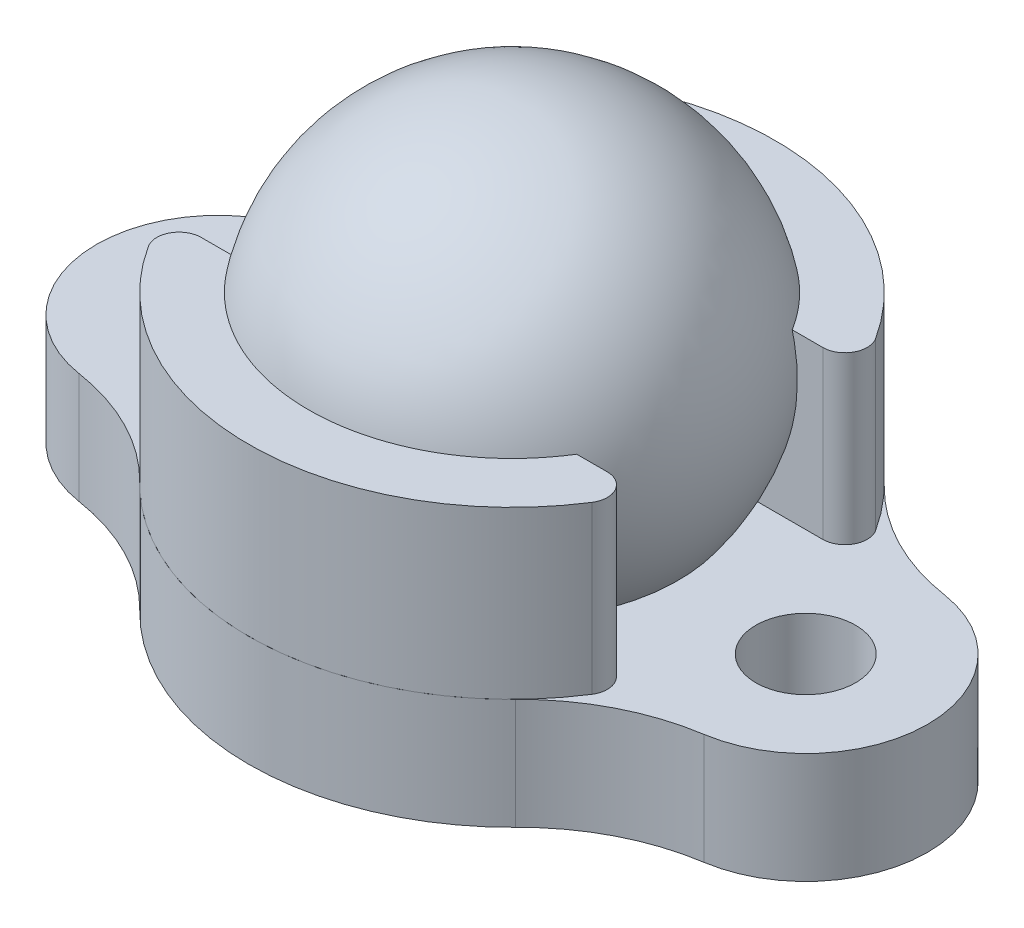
ISO-10303-21;
HEADER;
FILE_DESCRIPTION(('STEP AP214'),'2;1');
FILE_NAME('part.step','',(''),(''),'','','');
FILE_SCHEMA(('AUTOMOTIVE_DESIGN { 1 0 10303 214 1 1 1 1 }'));
ENDSEC;
DATA;
#1=APPLICATION_CONTEXT('core data for automotive mechanical design processes');
#2=APPLICATION_PROTOCOL_DEFINITION('international standard','automotive_design',2000,#1);
#3=PRODUCT_CONTEXT('',#1,'mechanical');
#4=PRODUCT('Part','Part','',(#3));
#5=PRODUCT_RELATED_PRODUCT_CATEGORY('part','',(#4));
#6=PRODUCT_DEFINITION_FORMATION('','',#4);
#7=PRODUCT_DEFINITION_CONTEXT('part definition',#1,'design');
#8=PRODUCT_DEFINITION('design','',#6,#7);
#9=PRODUCT_DEFINITION_SHAPE('','',#8);
#10=(LENGTH_UNIT() NAMED_UNIT(*) SI_UNIT(.MILLI.,.METRE.));
#11=(NAMED_UNIT(*) PLANE_ANGLE_UNIT() SI_UNIT($,.RADIAN.));
#12=(NAMED_UNIT(*) SI_UNIT($,.STERADIAN.) SOLID_ANGLE_UNIT());
#13=UNCERTAINTY_MEASURE_WITH_UNIT(LENGTH_MEASURE(1.E-05),#10,'distance_accuracy_value','');
#14=(GEOMETRIC_REPRESENTATION_CONTEXT(3) GLOBAL_UNCERTAINTY_ASSIGNED_CONTEXT((#13)) GLOBAL_UNIT_ASSIGNED_CONTEXT((#10,
#11,#12)) REPRESENTATION_CONTEXT('',''));
#15=CARTESIAN_POINT('',(0.,0.,0.));
#16=DIRECTION('',(0.,0.,1.));
#17=DIRECTION('',(1.,0.,0.));
#18=AXIS2_PLACEMENT_3D('',#15,#16,#17);
#19=CARTESIAN_POINT('',(0.,6.35,0.));
#20=DIRECTION('',(0.,-1.,0.));
#21=DIRECTION('',(0.,0.,-1.));
#22=AXIS2_PLACEMENT_3D('',#19,#20,#21);
#23=CYLINDRICAL_SURFACE('',#22,6.0325);
#24=CARTESIAN_POINT('',(0.,6.35,0.));
#25=DIRECTION('',(0.,1.,0.));
#26=DIRECTION('',(0.,0.,1.));
#27=AXIS2_PLACEMENT_3D('',#24,#25,#26);
#28=CIRCLE('',#27,6.0325);
#29=CARTESIAN_POINT('',(5.08156743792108,6.35,-3.25095810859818));
#30=VERTEX_POINT('',#29);
#31=CARTESIAN_POINT('',(-5.08156743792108,6.35,-3.25095810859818));
#32=VERTEX_POINT('',#31);
#33=EDGE_CURVE('E83',#30,#32,#28,.T.);
#34=ORIENTED_EDGE('',*,*,#33,.F.);
#35=DIRECTION('',(0.,-1.,0.));
#36=VECTOR('',#35,1.);
#37=CARTESIAN_POINT('',(5.08156743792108,6.35,-3.25095810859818));
#38=LINE('',#37,#36);
#39=CARTESIAN_POINT('',(5.08156743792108,2.54,-3.25095810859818));
#40=VERTEX_POINT('',#39);
#41=EDGE_CURVE('E91',#30,#40,#38,.T.);
#42=ORIENTED_EDGE('',*,*,#41,.T.);
#43=CARTESIAN_POINT('',(0.,2.54,0.));
#44=DIRECTION('',(0.,1.,0.));
#45=DIRECTION('',(0.,0.,1.));
#46=AXIS2_PLACEMENT_3D('',#43,#44,#45);
#47=CIRCLE('',#46,6.0325);
#48=CARTESIAN_POINT('',(-5.08156743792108,2.54,-3.25095810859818));
#49=VERTEX_POINT('',#48);
#50=EDGE_CURVE('E96',#40,#49,#47,.T.);
#51=ORIENTED_EDGE('',*,*,#50,.T.);
#52=DIRECTION('',(0.,-1.,0.));
#53=VECTOR('',#52,1.);
#54=CARTESIAN_POINT('',(-5.08156743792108,6.35,-3.25095810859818));
#55=LINE('',#54,#53);
#56=EDGE_CURVE('E94',#49,#32,#55,.F.);
#57=ORIENTED_EDGE('',*,*,#56,.T.);
#58=EDGE_LOOP('',(#34,#42,#51,#57));
#59=FACE_BOUND('',#58,.T.);
#60=ADVANCED_FACE('F43',(#59),#23,.T.);
#61=CARTESIAN_POINT('',(0.,6.35,0.));
#62=DIRECTION('',(0.,1.,0.));
#63=DIRECTION('',(0.,0.,1.));
#64=AXIS2_PLACEMENT_3D('',#61,#62,#63);
#65=PLANE('',#64);
#66=DIRECTION('',(-1.,0.,0.));
#67=VECTOR('',#66,1.);
#68=CARTESIAN_POINT('',(6.0325,6.35,-2.46919321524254));
#69=LINE('',#68,#67);
#70=CARTESIAN_POINT('',(4.65364596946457,6.35,-2.46919321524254));
#71=VERTEX_POINT('',#70);
#72=CARTESIAN_POINT('',(-4.65364596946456,6.35,-2.46919321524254));
#73=VERTEX_POINT('',#72);
#74=EDGE_CURVE('E84',#71,#73,#69,.T.);
#75=ORIENTED_EDGE('',*,*,#74,.F.);
#76=CARTESIAN_POINT('',(4.65364596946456,6.35,-2.97719321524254));
#77=DIRECTION('',(0.,1.,0.));
#78=DIRECTION('',(0.,0.,1.));
#79=AXIS2_PLACEMENT_3D('',#76,#77,#78);
#80=CIRCLE('',#79,0.508);
#81=EDGE_CURVE('E12',#71,#30,#80,.T.);
#82=ORIENTED_EDGE('',*,*,#81,.T.);
#83=ORIENTED_EDGE('',*,*,#33,.T.);
#84=CARTESIAN_POINT('',(-4.65364596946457,6.35,-2.97719321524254));
#85=DIRECTION('',(0.,1.,0.));
#86=DIRECTION('',(0.,0.,1.));
#87=AXIS2_PLACEMENT_3D('',#84,#85,#86);
#88=CIRCLE('',#87,0.508);
#89=EDGE_CURVE('E51',#32,#73,#88,.T.);
#90=ORIENTED_EDGE('',*,*,#89,.T.);
#91=EDGE_LOOP('',(#75,#82,#83,#90));
#92=FACE_BOUND('',#91,.T.);
#93=ADVANCED_FACE('F82',(#92),#65,.T.);
#94=CARTESIAN_POINT('',(0.,2.54,0.));
#95=DIRECTION('',(0.,1.,0.));
#96=DIRECTION('',(0.,0.,1.));
#97=AXIS2_PLACEMENT_3D('',#94,#95,#96);
#98=PLANE('',#97);
#99=ORIENTED_EDGE('',*,*,#50,.F.);
#100=CARTESIAN_POINT('',(4.65364596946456,2.54,-2.97719321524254));
#101=DIRECTION('',(0.,1.,0.));
#102=DIRECTION('',(0.,0.,1.));
#103=AXIS2_PLACEMENT_3D('',#100,#101,#102);
#104=CIRCLE('',#103,0.508);
#105=CARTESIAN_POINT('',(4.65364596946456,2.54,-2.46919321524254));
#106=VERTEX_POINT('',#105);
#107=EDGE_CURVE('E99',#40,#106,#104,.F.);
#108=ORIENTED_EDGE('',*,*,#107,.T.);
#109=DIRECTION('',(-1.,0.,0.));
#110=VECTOR('',#109,1.);
#111=CARTESIAN_POINT('',(0.,2.54,-2.46919321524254));
#112=LINE('',#111,#110);
#113=CARTESIAN_POINT('',(-4.65364596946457,2.54,-2.46919321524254));
#114=VERTEX_POINT('',#113);
#115=EDGE_CURVE('E95',#106,#114,#112,.T.);
#116=ORIENTED_EDGE('',*,*,#115,.T.);
#117=CARTESIAN_POINT('',(-4.65364596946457,2.54,-2.97719321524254));
#118=DIRECTION('',(0.,1.,0.));
#119=DIRECTION('',(0.,0.,1.));
#120=AXIS2_PLACEMENT_3D('',#117,#118,#119);
#121=CIRCLE('',#120,0.508);
#122=EDGE_CURVE('E100',#114,#49,#121,.F.);
#123=ORIENTED_EDGE('',*,*,#122,.T.);
#124=EDGE_LOOP('',(#99,#108,#116,#123));
#125=FACE_BOUND('',#124,.T.);
#126=ADVANCED_FACE('F115',(#125),#98,.F.);
#127=CARTESIAN_POINT('',(6.0325,-10.4965595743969,-2.46919321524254));
#128=DIRECTION('',(0.,0.,-1.));
#129=DIRECTION('',(-1.,0.,0.));
#130=AXIS2_PLACEMENT_3D('',#127,#128,#129);
#131=PLANE('',#130);
#132=ORIENTED_EDGE('',*,*,#115,.F.);
#133=DIRECTION('',(0.,-1.,0.));
#134=VECTOR('',#133,1.);
#135=CARTESIAN_POINT('',(4.65364596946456,-10.4965595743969,-2.46919321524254));
#136=LINE('',#135,#134);
#137=EDGE_CURVE('E64',#106,#71,#136,.F.);
#138=ORIENTED_EDGE('',*,*,#137,.T.);
#139=ORIENTED_EDGE('',*,*,#74,.T.);
#140=DIRECTION('',(0.,-1.,0.));
#141=VECTOR('',#140,1.);
#142=CARTESIAN_POINT('',(-4.65364596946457,-10.4965595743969,-2.46919321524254));
#143=LINE('',#142,#141);
#144=EDGE_CURVE('E107',#73,#114,#143,.T.);
#145=ORIENTED_EDGE('',*,*,#144,.T.);
#146=EDGE_LOOP('',(#132,#138,#139,#145));
#147=FACE_BOUND('',#146,.T.);
#148=ADVANCED_FACE('F111',(#147),#131,.F.);
#149=CARTESIAN_POINT('',(4.65364596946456,6.35,-2.97719321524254));
#150=DIRECTION('',(0.,-1.,0.));
#151=DIRECTION('',(0.,0.,-1.));
#152=AXIS2_PLACEMENT_3D('',#149,#150,#151);
#153=CYLINDRICAL_SURFACE('',#152,0.508);
#154=ORIENTED_EDGE('',*,*,#81,.F.);
#155=ORIENTED_EDGE('',*,*,#137,.F.);
#156=ORIENTED_EDGE('',*,*,#107,.F.);
#157=ORIENTED_EDGE('',*,*,#41,.F.);
#158=EDGE_LOOP('',(#154,#155,#156,#157));
#159=FACE_BOUND('',#158,.T.);
#160=ADVANCED_FACE('F98',(#159),#153,.T.);
#161=CARTESIAN_POINT('',(-4.65364596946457,6.35,-2.97719321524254));
#162=DIRECTION('',(0.,-1.,0.));
#163=DIRECTION('',(0.,0.,-1.));
#164=AXIS2_PLACEMENT_3D('',#161,#162,#163);
#165=CYLINDRICAL_SURFACE('',#164,0.508);
#166=ORIENTED_EDGE('',*,*,#122,.F.);
#167=ORIENTED_EDGE('',*,*,#144,.F.);
#168=ORIENTED_EDGE('',*,*,#89,.F.);
#169=ORIENTED_EDGE('',*,*,#56,.F.);
#170=EDGE_LOOP('',(#166,#167,#168,#169));
#171=FACE_BOUND('',#170,.T.);
#172=ADVANCED_FACE('F45',(#171),#165,.T.);
#173=CLOSED_SHELL('',(#60,#93,#126,#148,#160,#172));
#174=MANIFOLD_SOLID_BREP('B2',#173);
#175=CARTESIAN_POINT('',(0.,2.54,0.));
#176=DIRECTION('',(0.,1.,0.));
#177=DIRECTION('',(0.,0.,1.));
#178=AXIS2_PLACEMENT_3D('',#175,#176,#177);
#179=PLANE('',#178);
#180=CARTESIAN_POINT('',(0.,2.54,0.));
#181=DIRECTION('',(0.,1.,0.));
#182=DIRECTION('',(0.,0.,1.));
#183=AXIS2_PLACEMENT_3D('',#180,#181,#182);
#184=CIRCLE('',#183,6.0325);
#185=CARTESIAN_POINT('',(-5.08156743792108,2.54,3.25095810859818));
#186=VERTEX_POINT('',#185);
#187=CARTESIAN_POINT('',(5.08156743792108,2.54,3.25095810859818));
#188=VERTEX_POINT('',#187);
#189=EDGE_CURVE('E230',#186,#188,#184,.T.);
#190=ORIENTED_EDGE('',*,*,#189,.F.);
#191=CARTESIAN_POINT('',(-4.65364596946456,2.54,2.97719321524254));
#192=DIRECTION('',(0.,1.,0.));
#193=DIRECTION('',(0.,0.,1.));
#194=AXIS2_PLACEMENT_3D('',#191,#192,#193);
#195=CIRCLE('',#194,0.508);
#196=CARTESIAN_POINT('',(-4.65364596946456,2.54,2.46919321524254));
#197=VERTEX_POINT('',#196);
#198=EDGE_CURVE('E233',#186,#197,#195,.F.);
#199=ORIENTED_EDGE('',*,*,#198,.T.);
#200=DIRECTION('',(1.,0.,0.));
#201=VECTOR('',#200,1.);
#202=CARTESIAN_POINT('',(0.,2.54,2.46919321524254));
#203=LINE('',#202,#201);
#204=CARTESIAN_POINT('',(4.65364596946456,2.54,2.46919321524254));
#205=VERTEX_POINT('',#204);
#206=EDGE_CURVE('E229',#197,#205,#203,.T.);
#207=ORIENTED_EDGE('',*,*,#206,.T.);
#208=CARTESIAN_POINT('',(4.65364596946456,2.54,2.97719321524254));
#209=DIRECTION('',(0.,1.,0.));
#210=DIRECTION('',(0.,0.,1.));
#211=AXIS2_PLACEMENT_3D('',#208,#209,#210);
#212=CIRCLE('',#211,0.508);
#213=EDGE_CURVE('E234',#205,#188,#212,.F.);
#214=ORIENTED_EDGE('',*,*,#213,.T.);
#215=EDGE_LOOP('',(#190,#199,#207,#214));
#216=FACE_BOUND('',#215,.T.);
#217=ADVANCED_FACE('F176',(#216),#179,.F.);
#218=CARTESIAN_POINT('',(0.,6.35,0.));
#219=DIRECTION('',(0.,1.,0.));
#220=DIRECTION('',(0.,0.,1.));
#221=AXIS2_PLACEMENT_3D('',#218,#219,#220);
#222=PLANE('',#221);
#223=DIRECTION('',(1.,0.,0.));
#224=VECTOR('',#223,1.);
#225=CARTESIAN_POINT('',(6.0325,6.35,2.46919321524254));
#226=LINE('',#225,#224);
#227=CARTESIAN_POINT('',(-4.65364596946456,6.35,2.46919321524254));
#228=VERTEX_POINT('',#227);
#229=CARTESIAN_POINT('',(4.65364596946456,6.35,2.46919321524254));
#230=VERTEX_POINT('',#229);
#231=EDGE_CURVE('E217',#228,#230,#226,.T.);
#232=ORIENTED_EDGE('',*,*,#231,.F.);
#233=CARTESIAN_POINT('',(-4.65364596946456,6.35,2.97719321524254));
#234=DIRECTION('',(0.,1.,0.));
#235=DIRECTION('',(0.,0.,1.));
#236=AXIS2_PLACEMENT_3D('',#233,#234,#235);
#237=CIRCLE('',#236,0.508);
#238=CARTESIAN_POINT('',(-5.08156743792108,6.35,3.25095810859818));
#239=VERTEX_POINT('',#238);
#240=EDGE_CURVE('E41',#228,#239,#237,.T.);
#241=ORIENTED_EDGE('',*,*,#240,.T.);
#242=CARTESIAN_POINT('',(0.,6.35,0.));
#243=DIRECTION('',(0.,1.,0.));
#244=DIRECTION('',(0.,0.,1.));
#245=AXIS2_PLACEMENT_3D('',#242,#243,#244);
#246=CIRCLE('',#245,6.0325);
#247=CARTESIAN_POINT('',(5.08156743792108,6.35,3.25095810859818));
#248=VERTEX_POINT('',#247);
#249=EDGE_CURVE('E216',#239,#248,#246,.T.);
#250=ORIENTED_EDGE('',*,*,#249,.T.);
#251=CARTESIAN_POINT('',(4.65364596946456,6.35,2.97719321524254));
#252=DIRECTION('',(0.,1.,0.));
#253=DIRECTION('',(0.,0.,1.));
#254=AXIS2_PLACEMENT_3D('',#251,#252,#253);
#255=CIRCLE('',#254,0.508);
#256=EDGE_CURVE('E184',#248,#230,#255,.T.);
#257=ORIENTED_EDGE('',*,*,#256,.T.);
#258=EDGE_LOOP('',(#232,#241,#250,#257));
#259=FACE_BOUND('',#258,.T.);
#260=ADVANCED_FACE('F215',(#259),#222,.T.);
#261=CARTESIAN_POINT('',(0.,6.35,0.));
#262=DIRECTION('',(0.,-1.,0.));
#263=DIRECTION('',(0.,0.,-1.));
#264=AXIS2_PLACEMENT_3D('',#261,#262,#263);
#265=CYLINDRICAL_SURFACE('',#264,6.0325);
#266=ORIENTED_EDGE('',*,*,#249,.F.);
#267=DIRECTION('',(0.,-1.,0.));
#268=VECTOR('',#267,1.);
#269=CARTESIAN_POINT('',(-5.08156743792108,6.35,3.25095810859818));
#270=LINE('',#269,#268);
#271=EDGE_CURVE('E225',#239,#186,#270,.T.);
#272=ORIENTED_EDGE('',*,*,#271,.T.);
#273=ORIENTED_EDGE('',*,*,#189,.T.);
#274=DIRECTION('',(0.,-1.,0.));
#275=VECTOR('',#274,1.);
#276=CARTESIAN_POINT('',(5.08156743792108,6.35,3.25095810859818));
#277=LINE('',#276,#275);
#278=EDGE_CURVE('E228',#188,#248,#277,.F.);
#279=ORIENTED_EDGE('',*,*,#278,.T.);
#280=EDGE_LOOP('',(#266,#272,#273,#279));
#281=FACE_BOUND('',#280,.T.);
#282=ADVANCED_FACE('F223',(#281),#265,.T.);
#283=CARTESIAN_POINT('',(6.0325,-10.4965595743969,2.46919321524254));
#284=DIRECTION('',(0.,0.,1.));
#285=DIRECTION('',(1.,0.,0.));
#286=AXIS2_PLACEMENT_3D('',#283,#284,#285);
#287=PLANE('',#286);
#288=ORIENTED_EDGE('',*,*,#206,.F.);
#289=DIRECTION('',(0.,-1.,0.));
#290=VECTOR('',#289,1.);
#291=CARTESIAN_POINT('',(-4.65364596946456,-10.4965595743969,2.46919321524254));
#292=LINE('',#291,#290);
#293=EDGE_CURVE('E197',#197,#228,#292,.F.);
#294=ORIENTED_EDGE('',*,*,#293,.T.);
#295=ORIENTED_EDGE('',*,*,#231,.T.);
#296=DIRECTION('',(0.,-1.,0.));
#297=VECTOR('',#296,1.);
#298=CARTESIAN_POINT('',(4.65364596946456,-10.4965595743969,2.46919321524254));
#299=LINE('',#298,#297);
#300=EDGE_CURVE('E241',#230,#205,#299,.T.);
#301=ORIENTED_EDGE('',*,*,#300,.T.);
#302=EDGE_LOOP('',(#288,#294,#295,#301));
#303=FACE_BOUND('',#302,.T.);
#304=ADVANCED_FACE('F245',(#303),#287,.F.);
#305=CARTESIAN_POINT('',(-4.65364596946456,6.35,2.97719321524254));
#306=DIRECTION('',(0.,-1.,0.));
#307=DIRECTION('',(0.,0.,-1.));
#308=AXIS2_PLACEMENT_3D('',#305,#306,#307);
#309=CYLINDRICAL_SURFACE('',#308,0.508);
#310=ORIENTED_EDGE('',*,*,#240,.F.);
#311=ORIENTED_EDGE('',*,*,#293,.F.);
#312=ORIENTED_EDGE('',*,*,#198,.F.);
#313=ORIENTED_EDGE('',*,*,#271,.F.);
#314=EDGE_LOOP('',(#310,#311,#312,#313));
#315=FACE_BOUND('',#314,.T.);
#316=ADVANCED_FACE('F232',(#315),#309,.T.);
#317=CARTESIAN_POINT('',(4.65364596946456,6.35,2.97719321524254));
#318=DIRECTION('',(0.,-1.,0.));
#319=DIRECTION('',(0.,0.,-1.));
#320=AXIS2_PLACEMENT_3D('',#317,#318,#319);
#321=CYLINDRICAL_SURFACE('',#320,0.508);
#322=ORIENTED_EDGE('',*,*,#213,.F.);
#323=ORIENTED_EDGE('',*,*,#300,.F.);
#324=ORIENTED_EDGE('',*,*,#256,.F.);
#325=ORIENTED_EDGE('',*,*,#278,.F.);
#326=EDGE_LOOP('',(#322,#323,#324,#325));
#327=FACE_BOUND('',#326,.T.);
#328=ADVANCED_FACE('F178',(#327),#321,.T.);
#329=CLOSED_SHELL('',(#217,#260,#282,#304,#316,#328));
#330=MANIFOLD_SOLID_BREP('B6',#329);
#331=CARTESIAN_POINT('',(-3.96650353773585,2.54,3.89085642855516));
#332=DIRECTION('',(0.,-1.,0.));
#333=DIRECTION('',(0.,0.,-1.));
#334=AXIS2_PLACEMENT_3D('',#331,#332,#333);
#335=PLANE('',#334);
#336=CARTESIAN_POINT('',(6.731,2.54,0.));
#337=DIRECTION('',(0.,1.,0.));
#338=DIRECTION('',(0.,0.,1.));
#339=AXIS2_PLACEMENT_3D('',#336,#337,#338);
#340=CIRCLE('',#339,1.143);
#341=CARTESIAN_POINT('',(6.731,2.54,1.143));
#342=VERTEX_POINT('',#341);
#343=EDGE_CURVE('E453',#342,#342,#340,.T.);
#344=ORIENTED_EDGE('',*,*,#343,.F.);
#345=EDGE_LOOP('',(#344));
#346=FACE_BOUND('',#345,.T.);
#347=CARTESIAN_POINT('',(-7.9330070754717,2.54,7.78171285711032));
#348=DIRECTION('',(0.,-1.,0.));
#349=DIRECTION('',(0.,0.,-1.));
#350=AXIS2_PLACEMENT_3D('',#347,#348,#349);
#351=CIRCLE('',#350,5.08);
#352=CARTESIAN_POINT('',(-7.15751863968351,2.54,2.76125294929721));
#353=VERTEX_POINT('',#352);
#354=CARTESIAN_POINT('',(-4.30648955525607,2.54,4.2243584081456));
#355=VERTEX_POINT('',#354);
#356=EDGE_CURVE('E412',#353,#355,#351,.T.);
#357=ORIENTED_EDGE('',*,*,#356,.T.);
#358=CARTESIAN_POINT('',(0.,2.54,0.));
#359=DIRECTION('',(0.,1.,0.));
#360=DIRECTION('',(0.,0.,1.));
#361=AXIS2_PLACEMENT_3D('',#358,#359,#360);
#362=CIRCLE('',#361,6.0325);
#363=CARTESIAN_POINT('',(4.30648955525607,2.54,4.2243584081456));
#364=VERTEX_POINT('',#363);
#365=EDGE_CURVE('E360',#355,#364,#362,.T.);
#366=ORIENTED_EDGE('',*,*,#365,.T.);
#367=CARTESIAN_POINT('',(7.9330070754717,2.54,7.78171285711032));
#368=DIRECTION('',(0.,-1.,0.));
#369=DIRECTION('',(0.,0.,-1.));
#370=AXIS2_PLACEMENT_3D('',#367,#368,#369);
#371=CIRCLE('',#370,5.08);
#372=CARTESIAN_POINT('',(7.15751863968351,2.54,2.76125294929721));
#373=VERTEX_POINT('',#372);
#374=EDGE_CURVE('E444',#364,#373,#371,.T.);
#375=ORIENTED_EDGE('',*,*,#374,.T.);
#376=CARTESIAN_POINT('',(6.731,2.54,0.));
#377=DIRECTION('',(0.,1.,0.));
#378=DIRECTION('',(0.,0.,1.));
#379=AXIS2_PLACEMENT_3D('',#376,#377,#378);
#380=CIRCLE('',#379,2.794);
#381=CARTESIAN_POINT('',(7.15751863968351,2.54,-2.76125294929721));
#382=VERTEX_POINT('',#381);
#383=EDGE_CURVE('E443',#373,#382,#380,.T.);
#384=ORIENTED_EDGE('',*,*,#383,.T.);
#385=CARTESIAN_POINT('',(7.9330070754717,2.54,-7.78171285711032));
#386=DIRECTION('',(0.,-1.,0.));
#387=DIRECTION('',(0.,0.,-1.));
#388=AXIS2_PLACEMENT_3D('',#385,#386,#387);
#389=CIRCLE('',#388,5.08);
#390=CARTESIAN_POINT('',(4.30648955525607,2.54,-4.2243584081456));
#391=VERTEX_POINT('',#390);
#392=EDGE_CURVE('E379',#382,#391,#389,.T.);
#393=ORIENTED_EDGE('',*,*,#392,.T.);
#394=CARTESIAN_POINT('',(0.,2.54,0.));
#395=DIRECTION('',(0.,1.,0.));
#396=DIRECTION('',(0.,0.,1.));
#397=AXIS2_PLACEMENT_3D('',#394,#395,#396);
#398=CIRCLE('',#397,6.0325);
#399=CARTESIAN_POINT('',(-4.30648955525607,2.54,-4.2243584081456));
#400=VERTEX_POINT('',#399);
#401=EDGE_CURVE('E373',#391,#400,#398,.T.);
#402=ORIENTED_EDGE('',*,*,#401,.T.);
#403=CARTESIAN_POINT('',(-7.9330070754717,2.54,-7.78171285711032));
#404=DIRECTION('',(0.,-1.,0.));
#405=DIRECTION('',(0.,0.,1.));
#406=AXIS2_PLACEMENT_3D('',#403,#404,#405);
#407=CIRCLE('',#406,5.08);
#408=CARTESIAN_POINT('',(-7.1575186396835,2.54,-2.76125294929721));
#409=VERTEX_POINT('',#408);
#410=EDGE_CURVE('E377',#400,#409,#407,.T.);
#411=ORIENTED_EDGE('',*,*,#410,.T.);
#412=CARTESIAN_POINT('',(-6.731,2.54,0.));
#413=DIRECTION('',(0.,1.,0.));
#414=DIRECTION('',(0.,0.,1.));
#415=AXIS2_PLACEMENT_3D('',#412,#413,#414);
#416=CIRCLE('',#415,2.794);
#417=EDGE_CURVE('E316',#409,#353,#416,.T.);
#418=ORIENTED_EDGE('',*,*,#417,.T.);
#419=EDGE_LOOP('',(#357,#366,#375,#384,#393,#402,#411,#418));
#420=FACE_BOUND('',#419,.T.);
#421=CARTESIAN_POINT('',(-6.731,2.54,0.));
#422=DIRECTION('',(0.,1.,0.));
#423=DIRECTION('',(0.,0.,1.));
#424=AXIS2_PLACEMENT_3D('',#421,#422,#423);
#425=CIRCLE('',#424,1.143);
#426=CARTESIAN_POINT('',(-6.731,2.54,1.143));
#427=VERTEX_POINT('',#426);
#428=EDGE_CURVE('E401',#427,#427,#425,.T.);
#429=ORIENTED_EDGE('',*,*,#428,.F.);
#430=EDGE_LOOP('',(#429));
#431=FACE_BOUND('',#430,.T.);
#432=CARTESIAN_POINT('',(0.,2.54,0.));
#433=DIRECTION('',(0.,-1.,0.));
#434=DIRECTION('',(0.,0.,-1.));
#435=AXIS2_PLACEMENT_3D('',#432,#433,#434);
#436=CIRCLE('',#435,3.81);
#437=CARTESIAN_POINT('',(0.,2.54,-3.81));
#438=VERTEX_POINT('',#437);
#439=EDGE_CURVE('E174',#438,#438,#436,.F.);
#440=ORIENTED_EDGE('',*,*,#439,.F.);
#441=EDGE_LOOP('',(#440));
#442=FACE_BOUND('',#441,.T.);
#443=ADVANCED_FACE('F299',(#346,#420,#431,#442),#335,.F.);
#444=CARTESIAN_POINT('',(-3.96650353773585,0.,3.89085642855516));
#445=DIRECTION('',(0.,-1.,0.));
#446=DIRECTION('',(0.,0.,-1.));
#447=AXIS2_PLACEMENT_3D('',#444,#445,#446);
#448=PLANE('',#447);
#449=CARTESIAN_POINT('',(-6.731,0.,0.));
#450=DIRECTION('',(0.,1.,0.));
#451=DIRECTION('',(0.,0.,1.));
#452=AXIS2_PLACEMENT_3D('',#449,#450,#451);
#453=CIRCLE('',#452,1.143);
#454=CARTESIAN_POINT('',(-6.731,0.,1.143));
#455=VERTEX_POINT('',#454);
#456=EDGE_CURVE('E450',#455,#455,#453,.T.);
#457=ORIENTED_EDGE('',*,*,#456,.T.);
#458=EDGE_LOOP('',(#457));
#459=FACE_BOUND('',#458,.T.);
#460=CARTESIAN_POINT('',(-7.9330070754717,0.,7.78171285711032));
#461=DIRECTION('',(0.,-1.,0.));
#462=DIRECTION('',(0.,0.,-1.));
#463=AXIS2_PLACEMENT_3D('',#460,#461,#462);
#464=CIRCLE('',#463,5.08);
#465=CARTESIAN_POINT('',(-7.15751863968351,0.,2.76125294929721));
#466=VERTEX_POINT('',#465);
#467=CARTESIAN_POINT('',(-4.30648955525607,0.,4.2243584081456));
#468=VERTEX_POINT('',#467);
#469=EDGE_CURVE('E397',#466,#468,#464,.T.);
#470=ORIENTED_EDGE('',*,*,#469,.F.);
#471=CARTESIAN_POINT('',(-6.731,0.,0.));
#472=DIRECTION('',(0.,1.,0.));
#473=DIRECTION('',(0.,0.,1.));
#474=AXIS2_PLACEMENT_3D('',#471,#472,#473);
#475=CIRCLE('',#474,2.794);
#476=CARTESIAN_POINT('',(-7.1575186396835,0.,-2.76125294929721));
#477=VERTEX_POINT('',#476);
#478=EDGE_CURVE('E351',#477,#466,#475,.T.);
#479=ORIENTED_EDGE('',*,*,#478,.F.);
#480=CARTESIAN_POINT('',(-7.9330070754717,0.,-7.78171285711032));
#481=DIRECTION('',(0.,-1.,0.));
#482=DIRECTION('',(0.,0.,1.));
#483=AXIS2_PLACEMENT_3D('',#480,#481,#482);
#484=CIRCLE('',#483,5.08);
#485=CARTESIAN_POINT('',(-4.30648955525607,0.,-4.2243584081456));
#486=VERTEX_POINT('',#485);
#487=EDGE_CURVE('E345',#486,#477,#484,.T.);
#488=ORIENTED_EDGE('',*,*,#487,.F.);
#489=CARTESIAN_POINT('',(0.,0.,0.));
#490=DIRECTION('',(0.,1.,0.));
#491=DIRECTION('',(0.,0.,1.));
#492=AXIS2_PLACEMENT_3D('',#489,#490,#491);
#493=CIRCLE('',#492,6.0325);
#494=CARTESIAN_POINT('',(4.30648955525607,0.,-4.2243584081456));
#495=VERTEX_POINT('',#494);
#496=EDGE_CURVE('E387',#495,#486,#493,.T.);
#497=ORIENTED_EDGE('',*,*,#496,.F.);
#498=CARTESIAN_POINT('',(7.9330070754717,0.,-7.78171285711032));
#499=DIRECTION('',(0.,-1.,0.));
#500=DIRECTION('',(0.,0.,-1.));
#501=AXIS2_PLACEMENT_3D('',#498,#499,#500);
#502=CIRCLE('',#501,5.08);
#503=CARTESIAN_POINT('',(7.15751863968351,0.,-2.76125294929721));
#504=VERTEX_POINT('',#503);
#505=EDGE_CURVE('E407',#504,#495,#502,.T.);
#506=ORIENTED_EDGE('',*,*,#505,.F.);
#507=CARTESIAN_POINT('',(6.731,0.,0.));
#508=DIRECTION('',(0.,1.,0.));
#509=DIRECTION('',(0.,0.,1.));
#510=AXIS2_PLACEMENT_3D('',#507,#508,#509);
#511=CIRCLE('',#510,2.794);
#512=CARTESIAN_POINT('',(7.15751863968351,0.,2.76125294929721));
#513=VERTEX_POINT('',#512);
#514=EDGE_CURVE('E405',#513,#504,#511,.T.);
#515=ORIENTED_EDGE('',*,*,#514,.F.);
#516=CARTESIAN_POINT('',(7.9330070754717,0.,7.78171285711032));
#517=DIRECTION('',(0.,-1.,0.));
#518=DIRECTION('',(0.,0.,-1.));
#519=AXIS2_PLACEMENT_3D('',#516,#517,#518);
#520=CIRCLE('',#519,5.08);
#521=CARTESIAN_POINT('',(4.30648955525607,0.,4.2243584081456));
#522=VERTEX_POINT('',#521);
#523=EDGE_CURVE('E403',#522,#513,#520,.T.);
#524=ORIENTED_EDGE('',*,*,#523,.F.);
#525=CARTESIAN_POINT('',(0.,0.,0.));
#526=DIRECTION('',(0.,1.,0.));
#527=DIRECTION('',(0.,0.,1.));
#528=AXIS2_PLACEMENT_3D('',#525,#526,#527);
#529=CIRCLE('',#528,6.0325);
#530=EDGE_CURVE('E400',#468,#522,#529,.T.);
#531=ORIENTED_EDGE('',*,*,#530,.F.);
#532=EDGE_LOOP('',(#470,#479,#488,#497,#506,#515,#524,#531));
#533=FACE_BOUND('',#532,.T.);
#534=CARTESIAN_POINT('',(6.731,0.,0.));
#535=DIRECTION('',(0.,1.,0.));
#536=DIRECTION('',(0.,0.,1.));
#537=AXIS2_PLACEMENT_3D('',#534,#535,#536);
#538=CIRCLE('',#537,1.143);
#539=CARTESIAN_POINT('',(6.731,0.,1.143));
#540=VERTEX_POINT('',#539);
#541=EDGE_CURVE('E456',#540,#540,#538,.T.);
#542=ORIENTED_EDGE('',*,*,#541,.T.);
#543=EDGE_LOOP('',(#542));
#544=FACE_BOUND('',#543,.T.);
#545=ADVANCED_FACE('F430',(#459,#533,#544),#448,.T.);
#546=CARTESIAN_POINT('',(-7.9330070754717,2.54,7.78171285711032));
#547=DIRECTION('',(0.,-1.,0.));
#548=DIRECTION('',(0.,0.,-1.));
#549=AXIS2_PLACEMENT_3D('',#546,#547,#548);
#550=CYLINDRICAL_SURFACE('',#549,5.08);
#551=ORIENTED_EDGE('',*,*,#469,.T.);
#552=DIRECTION('',(0.,-1.,0.));
#553=VECTOR('',#552,1.);
#554=CARTESIAN_POINT('',(-4.30648955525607,2.54,4.2243584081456));
#555=LINE('',#554,#553);
#556=EDGE_CURVE('E308',#355,#468,#555,.T.);
#557=ORIENTED_EDGE('',*,*,#556,.F.);
#558=ORIENTED_EDGE('',*,*,#356,.F.);
#559=DIRECTION('',(0.,-1.,0.));
#560=VECTOR('',#559,1.);
#561=CARTESIAN_POINT('',(-7.15751863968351,2.54,2.76125294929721));
#562=LINE('',#561,#560);
#563=EDGE_CURVE('E393',#353,#466,#562,.T.);
#564=ORIENTED_EDGE('',*,*,#563,.T.);
#565=EDGE_LOOP('',(#551,#557,#558,#564));
#566=FACE_BOUND('',#565,.T.);
#567=ADVANCED_FACE('F301',(#566),#550,.F.);
#568=CARTESIAN_POINT('',(0.,2.54,0.));
#569=DIRECTION('',(0.,-1.,0.));
#570=DIRECTION('',(0.,0.,-1.));
#571=AXIS2_PLACEMENT_3D('',#568,#569,#570);
#572=CYLINDRICAL_SURFACE('',#571,6.0325);
#573=ORIENTED_EDGE('',*,*,#530,.T.);
#574=DIRECTION('',(0.,-1.,0.));
#575=VECTOR('',#574,1.);
#576=CARTESIAN_POINT('',(4.30648955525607,2.54,4.2243584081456));
#577=LINE('',#576,#575);
#578=EDGE_CURVE('E422',#364,#522,#577,.T.);
#579=ORIENTED_EDGE('',*,*,#578,.F.);
#580=ORIENTED_EDGE('',*,*,#365,.F.);
#581=ORIENTED_EDGE('',*,*,#556,.T.);
#582=EDGE_LOOP('',(#573,#579,#580,#581));
#583=FACE_BOUND('',#582,.T.);
#584=ADVANCED_FACE('F425',(#583),#572,.T.);
#585=CARTESIAN_POINT('',(7.9330070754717,2.54,7.78171285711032));
#586=DIRECTION('',(0.,-1.,0.));
#587=DIRECTION('',(0.,0.,-1.));
#588=AXIS2_PLACEMENT_3D('',#585,#586,#587);
#589=CYLINDRICAL_SURFACE('',#588,5.08);
#590=ORIENTED_EDGE('',*,*,#523,.T.);
#591=DIRECTION('',(0.,-1.,0.));
#592=VECTOR('',#591,1.);
#593=CARTESIAN_POINT('',(7.15751863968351,2.54,2.76125294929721));
#594=LINE('',#593,#592);
#595=EDGE_CURVE('E419',#373,#513,#594,.T.);
#596=ORIENTED_EDGE('',*,*,#595,.F.);
#597=ORIENTED_EDGE('',*,*,#374,.F.);
#598=ORIENTED_EDGE('',*,*,#578,.T.);
#599=EDGE_LOOP('',(#590,#596,#597,#598));
#600=FACE_BOUND('',#599,.T.);
#601=ADVANCED_FACE('F437',(#600),#589,.F.);
#602=CARTESIAN_POINT('',(6.731,2.54,0.));
#603=DIRECTION('',(0.,-1.,0.));
#604=DIRECTION('',(0.,0.,-1.));
#605=AXIS2_PLACEMENT_3D('',#602,#603,#604);
#606=CYLINDRICAL_SURFACE('',#605,2.794);
#607=ORIENTED_EDGE('',*,*,#514,.T.);
#608=DIRECTION('',(0.,-1.,0.));
#609=VECTOR('',#608,1.);
#610=CARTESIAN_POINT('',(7.15751863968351,2.54,-2.76125294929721));
#611=LINE('',#610,#609);
#612=EDGE_CURVE('E416',#382,#504,#611,.T.);
#613=ORIENTED_EDGE('',*,*,#612,.F.);
#614=ORIENTED_EDGE('',*,*,#383,.F.);
#615=ORIENTED_EDGE('',*,*,#595,.T.);
#616=EDGE_LOOP('',(#607,#613,#614,#615));
#617=FACE_BOUND('',#616,.T.);
#618=ADVANCED_FACE('F441',(#617),#606,.T.);
#619=CARTESIAN_POINT('',(7.9330070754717,2.54,-7.78171285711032));
#620=DIRECTION('',(0.,-1.,0.));
#621=DIRECTION('',(0.,0.,-1.));
#622=AXIS2_PLACEMENT_3D('',#619,#620,#621);
#623=CYLINDRICAL_SURFACE('',#622,5.08);
#624=ORIENTED_EDGE('',*,*,#505,.T.);
#625=DIRECTION('',(0.,-1.,0.));
#626=VECTOR('',#625,1.);
#627=CARTESIAN_POINT('',(4.30648955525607,2.54,-4.2243584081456));
#628=LINE('',#627,#626);
#629=EDGE_CURVE('E388',#391,#495,#628,.T.);
#630=ORIENTED_EDGE('',*,*,#629,.F.);
#631=ORIENTED_EDGE('',*,*,#392,.F.);
#632=ORIENTED_EDGE('',*,*,#612,.T.);
#633=EDGE_LOOP('',(#624,#630,#631,#632));
#634=FACE_BOUND('',#633,.T.);
#635=ADVANCED_FACE('F483',(#634),#623,.F.);
#636=CARTESIAN_POINT('',(0.,2.54,0.));
#637=DIRECTION('',(0.,-1.,0.));
#638=DIRECTION('',(0.,0.,-1.));
#639=AXIS2_PLACEMENT_3D('',#636,#637,#638);
#640=CYLINDRICAL_SURFACE('',#639,6.0325);
#641=ORIENTED_EDGE('',*,*,#496,.T.);
#642=DIRECTION('',(0.,-1.,0.));
#643=VECTOR('',#642,1.);
#644=CARTESIAN_POINT('',(-4.30648955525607,2.54,-4.2243584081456));
#645=LINE('',#644,#643);
#646=EDGE_CURVE('E384',#400,#486,#645,.T.);
#647=ORIENTED_EDGE('',*,*,#646,.F.);
#648=ORIENTED_EDGE('',*,*,#401,.F.);
#649=ORIENTED_EDGE('',*,*,#629,.T.);
#650=EDGE_LOOP('',(#641,#647,#648,#649));
#651=FACE_BOUND('',#650,.T.);
#652=ADVANCED_FACE('F385',(#651),#640,.T.);
#653=CARTESIAN_POINT('',(-7.9330070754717,2.54,-7.78171285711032));
#654=DIRECTION('',(0.,-1.,0.));
#655=DIRECTION('',(0.,0.,-1.));
#656=AXIS2_PLACEMENT_3D('',#653,#654,#655);
#657=CYLINDRICAL_SURFACE('',#656,5.08);
#658=ORIENTED_EDGE('',*,*,#487,.T.);
#659=DIRECTION('',(0.,-1.,0.));
#660=VECTOR('',#659,1.);
#661=CARTESIAN_POINT('',(-7.1575186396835,2.54,-2.76125294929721));
#662=LINE('',#661,#660);
#663=EDGE_CURVE('E389',#409,#477,#662,.T.);
#664=ORIENTED_EDGE('',*,*,#663,.F.);
#665=ORIENTED_EDGE('',*,*,#410,.F.);
#666=ORIENTED_EDGE('',*,*,#646,.T.);
#667=EDGE_LOOP('',(#658,#664,#665,#666));
#668=FACE_BOUND('',#667,.T.);
#669=ADVANCED_FACE('F391',(#668),#657,.F.);
#670=CARTESIAN_POINT('',(-6.731,2.54,0.));
#671=DIRECTION('',(0.,-1.,0.));
#672=DIRECTION('',(0.,0.,-1.));
#673=AXIS2_PLACEMENT_3D('',#670,#671,#672);
#674=CYLINDRICAL_SURFACE('',#673,2.794);
#675=ORIENTED_EDGE('',*,*,#478,.T.);
#676=ORIENTED_EDGE('',*,*,#563,.F.);
#677=ORIENTED_EDGE('',*,*,#417,.F.);
#678=ORIENTED_EDGE('',*,*,#663,.T.);
#679=EDGE_LOOP('',(#675,#676,#677,#678));
#680=FACE_BOUND('',#679,.T.);
#681=ADVANCED_FACE('F476',(#680),#674,.T.);
#682=CARTESIAN_POINT('',(-6.731,2.54,0.));
#683=DIRECTION('',(0.,-1.,0.));
#684=DIRECTION('',(0.,0.,-1.));
#685=AXIS2_PLACEMENT_3D('',#682,#683,#684);
#686=CYLINDRICAL_SURFACE('',#685,1.143);
#687=ORIENTED_EDGE('',*,*,#428,.T.);
#688=EDGE_LOOP('',(#687));
#689=FACE_BOUND('',#688,.T.);
#690=ORIENTED_EDGE('',*,*,#456,.F.);
#691=EDGE_LOOP('',(#690));
#692=FACE_BOUND('',#691,.T.);
#693=ADVANCED_FACE('F473',(#689,#692),#686,.F.);
#694=CARTESIAN_POINT('',(6.731,2.54,0.));
#695=DIRECTION('',(0.,-1.,0.));
#696=DIRECTION('',(0.,0.,-1.));
#697=AXIS2_PLACEMENT_3D('',#694,#695,#696);
#698=CYLINDRICAL_SURFACE('',#697,1.143);
#699=ORIENTED_EDGE('',*,*,#343,.T.);
#700=EDGE_LOOP('',(#699));
#701=FACE_BOUND('',#700,.T.);
#702=ORIENTED_EDGE('',*,*,#541,.F.);
#703=EDGE_LOOP('',(#702));
#704=FACE_BOUND('',#703,.T.);
#705=ADVANCED_FACE('F462',(#701,#704),#698,.F.);
#706=CARTESIAN_POINT('',(0.,5.3975,0.));
#707=DIRECTION('',(0.,1.,0.));
#708=DIRECTION('',(-1.,0.,0.));
#709=AXIS2_PLACEMENT_3D('',#706,#707,#708);
#710=SPHERICAL_SURFACE('',#709,4.7625);
#711=ORIENTED_EDGE('',*,*,#439,.T.);
#712=EDGE_LOOP('',(#711));
#713=FACE_BOUND('',#712,.T.);
#714=ADVANCED_FACE('F553',(#713),#710,.T.);
#715=CLOSED_SHELL('',(#443,#545,#567,#584,#601,#618,#635,#652,#669,#681,#693,#705,#714));
#716=MANIFOLD_SOLID_BREP('B35',#715);
#717=ADVANCED_BREP_SHAPE_REPRESENTATION('',(#18,#174,#330,#716),#14);
#718=SHAPE_DEFINITION_REPRESENTATION(#9,#717);
ENDSEC;
END-ISO-10303-21;
